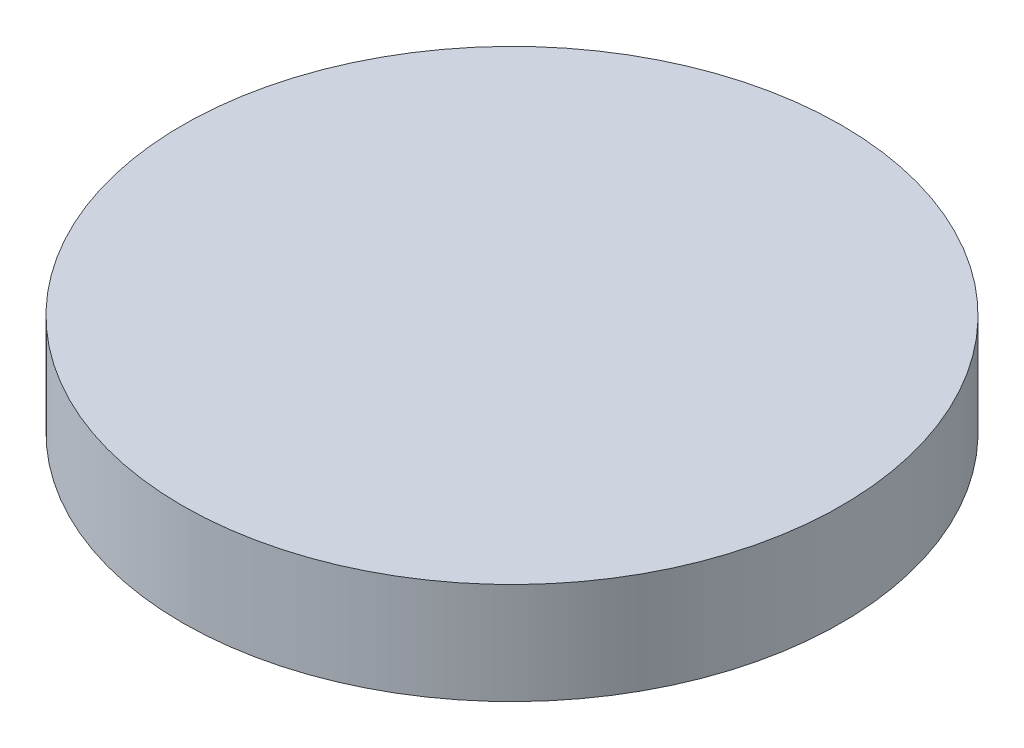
from build123d import *

# Parameters (mm, degrees)
CROQUIS1_R              = 39
SALIENTE_EXTRUIR1_DEPTH = 12


with BuildPart() as part:
    # Croquis1 → Saliente-Extruir1 (new body)
    with BuildSketch(Plane(origin=(0, 0, 0), x_dir=(1, 0, 0), z_dir=(0, 1, 0))):
        with Locations(Location((0, 0, 0), (0, 0, 270))):
            Circle(CROQUIS1_R)
    extrude(amount=SALIENTE_EXTRUIR1_DEPTH)


solid = part.part
